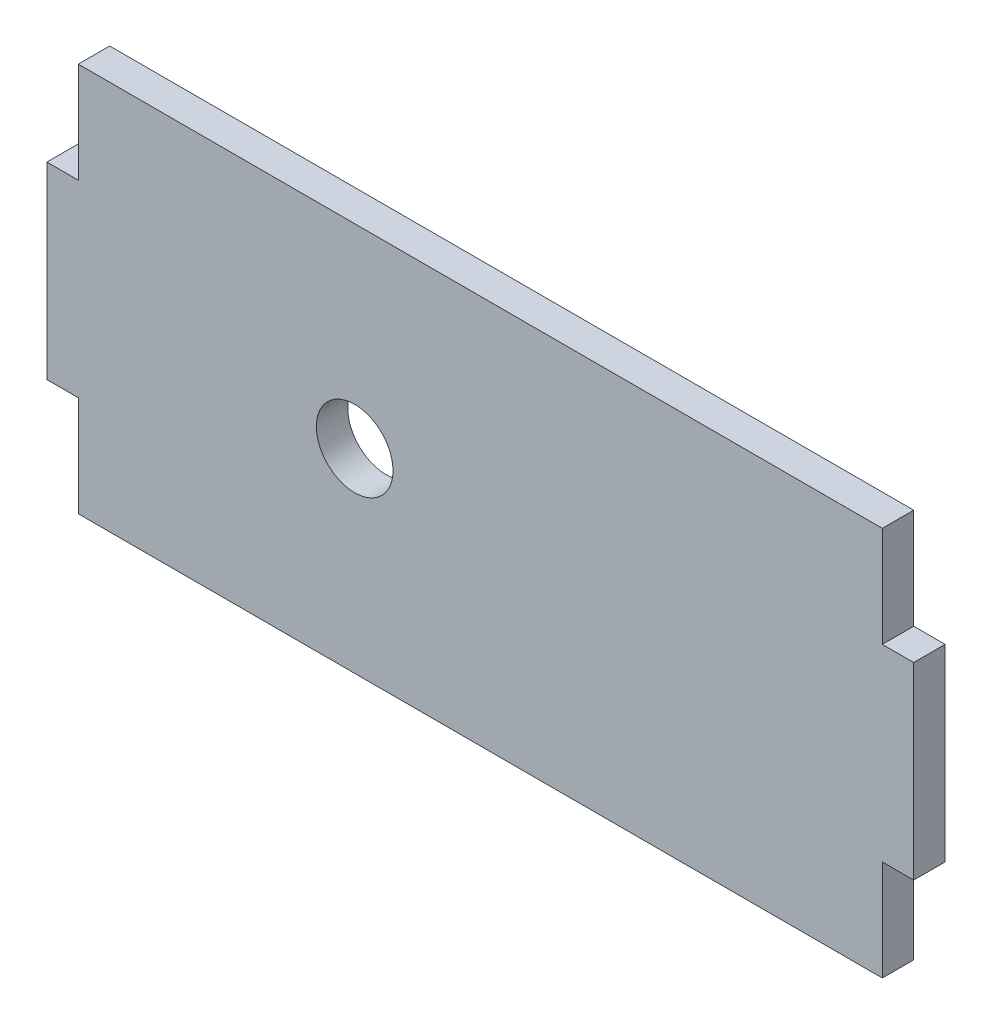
from build123d import *

# Parameters (mm, degrees)
BOSS_EXTRUDE1_DEPTH = 2.5
SKETCH2_R           = 3.05
CUT_EXTRUDE1_DEPTH  = 2.5


with BuildPart() as part:
    # Sketch1 → Boss-Extrude1 (new body)
    with BuildSketch(Plane.XY):
        Polygon((-2.5, 7.5), (0, 7.5), (0, 15.5), (64, 15.5), (64, 7.5), (66.5, 7.5), (66.5, -7.5), (64, -7.5), (64, -15.5), (0, -15.5), (0, -7.5), (-2.5, -7.5), align=None)
    extrude(amount=BOSS_EXTRUDE1_DEPTH)

    # Sketch2 → Cut-Extrude1 (cut)
    with BuildSketch(Plane.XY.offset(2.5)):
        with Locations((22, 0)):
            Circle(SKETCH2_R)
    extrude(amount=-CUT_EXTRUDE1_DEPTH, mode=Mode.SUBTRACT)


solid = part.part
